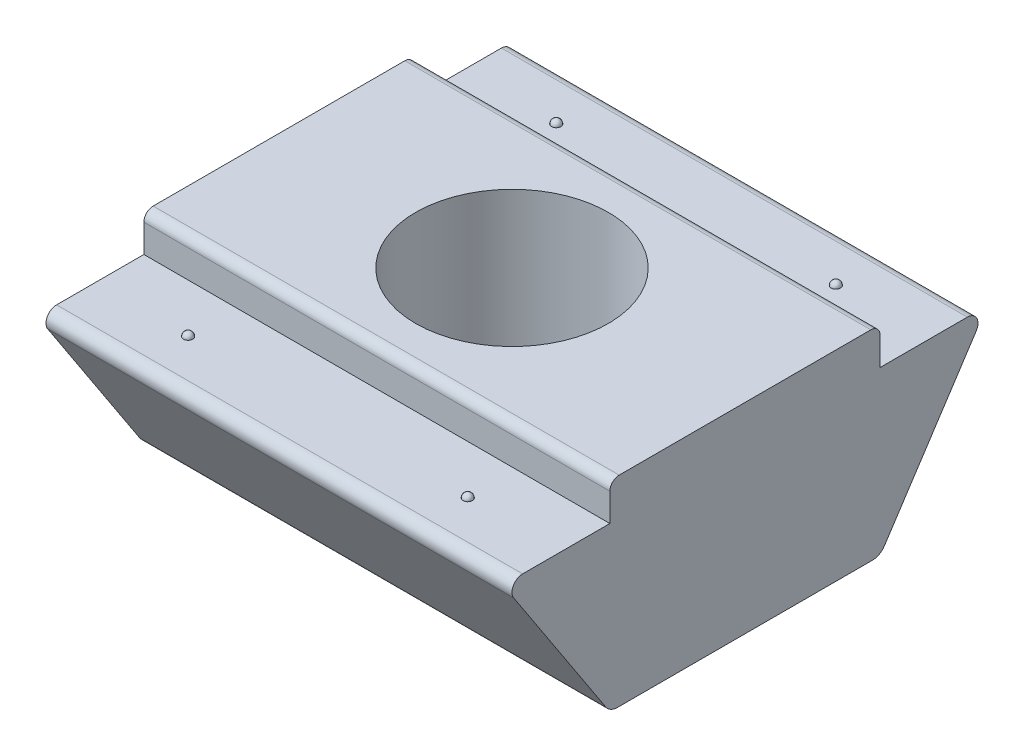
ISO-10303-21;
HEADER;
FILE_DESCRIPTION(('STEP AP214'),'2;1');
FILE_NAME('part.step','',(''),(''),'','','');
FILE_SCHEMA(('AUTOMOTIVE_DESIGN { 1 0 10303 214 1 1 1 1 }'));
ENDSEC;
DATA;
#1=APPLICATION_CONTEXT('core data for automotive mechanical design processes');
#2=APPLICATION_PROTOCOL_DEFINITION('international standard','automotive_design',2000,#1);
#3=PRODUCT_CONTEXT('',#1,'mechanical');
#4=PRODUCT('Part','Part','',(#3));
#5=PRODUCT_RELATED_PRODUCT_CATEGORY('part','',(#4));
#6=PRODUCT_DEFINITION_FORMATION('','',#4);
#7=PRODUCT_DEFINITION_CONTEXT('part definition',#1,'design');
#8=PRODUCT_DEFINITION('design','',#6,#7);
#9=PRODUCT_DEFINITION_SHAPE('','',#8);
#10=(LENGTH_UNIT() NAMED_UNIT(*) SI_UNIT(.MILLI.,.METRE.));
#11=(NAMED_UNIT(*) PLANE_ANGLE_UNIT() SI_UNIT($,.RADIAN.));
#12=(NAMED_UNIT(*) SI_UNIT($,.STERADIAN.) SOLID_ANGLE_UNIT());
#13=UNCERTAINTY_MEASURE_WITH_UNIT(LENGTH_MEASURE(1.E-05),#10,'distance_accuracy_value','');
#14=(GEOMETRIC_REPRESENTATION_CONTEXT(3) GLOBAL_UNCERTAINTY_ASSIGNED_CONTEXT((#13)) GLOBAL_UNIT_ASSIGNED_CONTEXT((#10,
#11,#12)) REPRESENTATION_CONTEXT('',''));
#15=CARTESIAN_POINT('',(0.,0.,0.));
#16=DIRECTION('',(0.,0.,1.));
#17=DIRECTION('',(1.,0.,0.));
#18=AXIS2_PLACEMENT_3D('',#15,#16,#17);
#19=CARTESIAN_POINT('',(5.,0.,-2.9));
#20=DIRECTION('',(0.,-1.,0.));
#21=DIRECTION('',(0.,0.,-1.));
#22=AXIS2_PLACEMENT_3D('',#19,#20,#21);
#23=PLANE('',#22);
#24=CARTESIAN_POINT('',(-3.,0.,-3.95));
#25=DIRECTION('',(0.,-1.,0.));
#26=DIRECTION('',(0.,0.,-1.));
#27=AXIS2_PLACEMENT_3D('',#24,#25,#26);
#28=CIRCLE('',#27,0.1);
#29=CARTESIAN_POINT('',(-3.,0.,-4.05));
#30=VERTEX_POINT('',#29);
#31=EDGE_CURVE('E42',#30,#30,#28,.F.);
#32=ORIENTED_EDGE('',*,*,#31,.F.);
#33=EDGE_LOOP('',(#32));
#34=FACE_BOUND('',#33,.T.);
#35=DIRECTION('',(0.,0.,1.));
#36=VECTOR('',#35,1.);
#37=CARTESIAN_POINT('',(-5.,0.,-2.9));
#38=LINE('',#37,#36);
#39=CARTESIAN_POINT('',(-5.,0.,-4.772));
#40=VERTEX_POINT('',#39);
#41=CARTESIAN_POINT('',(-5.,0.,-2.9));
#42=VERTEX_POINT('',#41);
#43=EDGE_CURVE('E218',#40,#42,#38,.T.);
#44=ORIENTED_EDGE('',*,*,#43,.T.);
#45=DIRECTION('',(-1.,0.,0.));
#46=VECTOR('',#45,1.);
#47=CARTESIAN_POINT('',(5.,0.,-2.9));
#48=LINE('',#47,#46);
#49=CARTESIAN_POINT('',(5.,0.,-2.9));
#50=VERTEX_POINT('',#49);
#51=EDGE_CURVE('E168',#50,#42,#48,.T.);
#52=ORIENTED_EDGE('',*,*,#51,.F.);
#53=DIRECTION('',(0.,0.,1.));
#54=VECTOR('',#53,1.);
#55=CARTESIAN_POINT('',(5.,0.,-2.9));
#56=LINE('',#55,#54);
#57=CARTESIAN_POINT('',(5.,0.,-4.772));
#58=VERTEX_POINT('',#57);
#59=EDGE_CURVE('E158',#58,#50,#56,.T.);
#60=ORIENTED_EDGE('',*,*,#59,.F.);
#61=DIRECTION('',(-1.,0.,0.));
#62=VECTOR('',#61,1.);
#63=CARTESIAN_POINT('',(5.,0.,-4.772));
#64=LINE('',#63,#62);
#65=EDGE_CURVE('E156',#58,#40,#64,.T.);
#66=ORIENTED_EDGE('',*,*,#65,.T.);
#67=EDGE_LOOP('',(#44,#52,#60,#66));
#68=FACE_BOUND('',#67,.T.);
#69=CARTESIAN_POINT('',(3.,0.,-3.95));
#70=DIRECTION('',(0.,-1.,0.));
#71=DIRECTION('',(0.,0.,-1.));
#72=AXIS2_PLACEMENT_3D('',#69,#70,#71);
#73=CIRCLE('',#72,0.1);
#74=CARTESIAN_POINT('',(3.,0.,-4.05));
#75=VERTEX_POINT('',#74);
#76=EDGE_CURVE('E11',#75,#75,#73,.F.);
#77=ORIENTED_EDGE('',*,*,#76,.F.);
#78=EDGE_LOOP('',(#77));
#79=FACE_BOUND('',#78,.T.);
#80=ADVANCED_FACE('F34',(#34,#68,#79),#23,.F.);
#81=CARTESIAN_POINT('',(5.,0.,4.772));
#82=DIRECTION('',(0.,-1.,0.));
#83=DIRECTION('',(0.,0.,-1.));
#84=AXIS2_PLACEMENT_3D('',#81,#82,#83);
#85=PLANE('',#84);
#86=CARTESIAN_POINT('',(-3.,0.,3.95));
#87=DIRECTION('',(0.,-1.,0.));
#88=DIRECTION('',(0.,0.,-1.));
#89=AXIS2_PLACEMENT_3D('',#86,#87,#88);
#90=CIRCLE('',#89,0.1);
#91=CARTESIAN_POINT('',(-3.,0.,3.85));
#92=VERTEX_POINT('',#91);
#93=EDGE_CURVE('E201',#92,#92,#90,.F.);
#94=ORIENTED_EDGE('',*,*,#93,.F.);
#95=EDGE_LOOP('',(#94));
#96=FACE_BOUND('',#95,.T.);
#97=DIRECTION('',(0.,0.,1.));
#98=VECTOR('',#97,1.);
#99=CARTESIAN_POINT('',(-5.,0.,4.772));
#100=LINE('',#99,#98);
#101=CARTESIAN_POINT('',(-5.,0.,2.9));
#102=VERTEX_POINT('',#101);
#103=CARTESIAN_POINT('',(-5.,0.,4.772));
#104=VERTEX_POINT('',#103);
#105=EDGE_CURVE('E313',#102,#104,#100,.T.);
#106=ORIENTED_EDGE('',*,*,#105,.T.);
#107=DIRECTION('',(-1.,0.,0.));
#108=VECTOR('',#107,1.);
#109=CARTESIAN_POINT('',(5.,0.,4.772));
#110=LINE('',#109,#108);
#111=CARTESIAN_POINT('',(5.,0.,4.772));
#112=VERTEX_POINT('',#111);
#113=EDGE_CURVE('E323',#112,#104,#110,.T.);
#114=ORIENTED_EDGE('',*,*,#113,.F.);
#115=DIRECTION('',(0.,0.,1.));
#116=VECTOR('',#115,1.);
#117=CARTESIAN_POINT('',(5.,0.,4.772));
#118=LINE('',#117,#116);
#119=CARTESIAN_POINT('',(5.,0.,2.9));
#120=VERTEX_POINT('',#119);
#121=EDGE_CURVE('E344',#120,#112,#118,.T.);
#122=ORIENTED_EDGE('',*,*,#121,.F.);
#123=DIRECTION('',(-1.,0.,0.));
#124=VECTOR('',#123,1.);
#125=CARTESIAN_POINT('',(5.,0.,2.9));
#126=LINE('',#125,#124);
#127=EDGE_CURVE('E326',#120,#102,#126,.T.);
#128=ORIENTED_EDGE('',*,*,#127,.T.);
#129=EDGE_LOOP('',(#106,#114,#122,#128));
#130=FACE_BOUND('',#129,.T.);
#131=CARTESIAN_POINT('',(3.,0.,3.95));
#132=DIRECTION('',(0.,-1.,0.));
#133=DIRECTION('',(0.,0.,-1.));
#134=AXIS2_PLACEMENT_3D('',#131,#132,#133);
#135=CIRCLE('',#134,0.1);
#136=CARTESIAN_POINT('',(3.,0.,3.85));
#137=VERTEX_POINT('',#136);
#138=EDGE_CURVE('E204',#137,#137,#135,.F.);
#139=ORIENTED_EDGE('',*,*,#138,.F.);
#140=EDGE_LOOP('',(#139));
#141=FACE_BOUND('',#140,.T.);
#142=ADVANCED_FACE('F213',(#96,#130,#141),#85,.F.);
#143=CARTESIAN_POINT('',(5.,-0.352986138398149,-4.96268944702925));
#144=DIRECTION('',(0.,0.548184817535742,0.836357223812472));
#145=DIRECTION('',(0.,-0.836357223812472,0.548184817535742));
#146=AXIS2_PLACEMENT_3D('',#143,#144,#145);
#147=PLANE('',#146);
#148=DIRECTION('',(0.,0.836357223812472,-0.548184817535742));
#149=VECTOR('',#148,1.);
#150=CARTESIAN_POINT('',(5.,-0.352986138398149,-4.96268944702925));
#151=LINE('',#150,#149);
#152=CARTESIAN_POINT('',(5.,-3.36445544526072,-2.98884178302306));
#153=VERTEX_POINT('',#152);
#154=CARTESIAN_POINT('',(5.,-0.352986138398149,-4.96268944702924));
#155=VERTEX_POINT('',#154);
#156=EDGE_CURVE('E138',#153,#155,#151,.T.);
#157=ORIENTED_EDGE('',*,*,#156,.F.);
#158=DIRECTION('',(-1.,0.,0.));
#159=VECTOR('',#158,1.);
#160=CARTESIAN_POINT('',(5.,-3.36445544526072,-2.98884178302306));
#161=LINE('',#160,#159);
#162=CARTESIAN_POINT('',(-5.,-3.36445544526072,-2.98884178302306));
#163=VERTEX_POINT('',#162);
#164=EDGE_CURVE('E187',#153,#163,#161,.T.);
#165=ORIENTED_EDGE('',*,*,#164,.T.);
#166=DIRECTION('',(0.,0.836357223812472,-0.548184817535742));
#167=VECTOR('',#166,1.);
#168=CARTESIAN_POINT('',(-5.,-0.352986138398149,-4.96268944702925));
#169=LINE('',#168,#167);
#170=CARTESIAN_POINT('',(-5.,-0.352986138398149,-4.96268944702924));
#171=VERTEX_POINT('',#170);
#172=EDGE_CURVE('E162',#163,#171,#169,.T.);
#173=ORIENTED_EDGE('',*,*,#172,.T.);
#174=DIRECTION('',(-1.,0.,0.));
#175=VECTOR('',#174,1.);
#176=CARTESIAN_POINT('',(5.,-0.352986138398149,-4.96268944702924));
#177=LINE('',#176,#175);
#178=EDGE_CURVE('E154',#155,#171,#177,.T.);
#179=ORIENTED_EDGE('',*,*,#178,.F.);
#180=EDGE_LOOP('',(#157,#165,#173,#179));
#181=FACE_BOUND('',#180,.T.);
#182=ADVANCED_FACE('F160',(#181),#147,.F.);
#183=CARTESIAN_POINT('',(5.,-0.227999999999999,-4.772));
#184=DIRECTION('',(-1.,0.,0.));
#185=DIRECTION('',(0.,0.,1.));
#186=AXIS2_PLACEMENT_3D('',#183,#184,#185);
#187=CYLINDRICAL_SURFACE('',#186,0.228000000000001);
#188=CARTESIAN_POINT('',(-5.,-0.227999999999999,-4.772));
#189=DIRECTION('',(1.,0.,0.));
#190=DIRECTION('',(0.,0.,1.));
#191=AXIS2_PLACEMENT_3D('',#188,#189,#190);
#192=CIRCLE('',#191,0.228000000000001);
#193=EDGE_CURVE('E293',#171,#40,#192,.T.);
#194=ORIENTED_EDGE('',*,*,#193,.T.);
#195=ORIENTED_EDGE('',*,*,#65,.F.);
#196=CARTESIAN_POINT('',(5.,-0.227999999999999,-4.772));
#197=DIRECTION('',(1.,0.,0.));
#198=DIRECTION('',(0.,0.,1.));
#199=AXIS2_PLACEMENT_3D('',#196,#197,#198);
#200=CIRCLE('',#199,0.228000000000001);
#201=EDGE_CURVE('E141',#155,#58,#200,.T.);
#202=ORIENTED_EDGE('',*,*,#201,.F.);
#203=ORIENTED_EDGE('',*,*,#178,.T.);
#204=EDGE_LOOP('',(#194,#195,#202,#203));
#205=FACE_BOUND('',#204,.T.);
#206=ADVANCED_FACE('F153',(#205),#187,.T.);
#207=CARTESIAN_POINT('',(5.,0.799999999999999,-2.9));
#208=DIRECTION('',(0.,0.,1.));
#209=DIRECTION('',(1.,0.,0.));
#210=AXIS2_PLACEMENT_3D('',#207,#208,#209);
#211=PLANE('',#210);
#212=DIRECTION('',(0.,1.,0.));
#213=VECTOR('',#212,1.);
#214=CARTESIAN_POINT('',(-5.,0.799999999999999,-2.9));
#215=LINE('',#214,#213);
#216=CARTESIAN_POINT('',(-5.,0.6,-2.9));
#217=VERTEX_POINT('',#216);
#218=EDGE_CURVE('E305',#42,#217,#215,.T.);
#219=ORIENTED_EDGE('',*,*,#218,.T.);
#220=DIRECTION('',(-1.,0.,0.));
#221=VECTOR('',#220,1.);
#222=CARTESIAN_POINT('',(5.,0.6,-2.9));
#223=LINE('',#222,#221);
#224=CARTESIAN_POINT('',(5.,0.6,-2.9));
#225=VERTEX_POINT('',#224);
#226=EDGE_CURVE('E178',#217,#225,#223,.F.);
#227=ORIENTED_EDGE('',*,*,#226,.T.);
#228=DIRECTION('',(0.,1.,0.));
#229=VECTOR('',#228,1.);
#230=CARTESIAN_POINT('',(5.,0.799999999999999,-2.9));
#231=LINE('',#230,#229);
#232=EDGE_CURVE('E332',#50,#225,#231,.T.);
#233=ORIENTED_EDGE('',*,*,#232,.F.);
#234=ORIENTED_EDGE('',*,*,#51,.T.);
#235=EDGE_LOOP('',(#219,#227,#233,#234));
#236=FACE_BOUND('',#235,.T.);
#237=ADVANCED_FACE('F270',(#236),#211,.F.);
#238=CARTESIAN_POINT('',(5.,0.799999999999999,2.9));
#239=DIRECTION('',(0.,-1.,0.));
#240=DIRECTION('',(0.,0.,-1.));
#241=AXIS2_PLACEMENT_3D('',#238,#239,#240);
#242=PLANE('',#241);
#243=CARTESIAN_POINT('',(0.,0.799999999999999,0.));
#244=DIRECTION('',(0.,1.,0.));
#245=DIRECTION('',(0.,0.,1.));
#246=AXIS2_PLACEMENT_3D('',#243,#244,#245);
#247=CIRCLE('',#246,2.067);
#248=CARTESIAN_POINT('',(0.,0.799999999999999,2.067));
#249=VERTEX_POINT('',#248);
#250=EDGE_CURVE('E298',#249,#249,#247,.T.);
#251=ORIENTED_EDGE('',*,*,#250,.F.);
#252=EDGE_LOOP('',(#251));
#253=FACE_BOUND('',#252,.T.);
#254=DIRECTION('',(0.,0.,1.));
#255=VECTOR('',#254,1.);
#256=CARTESIAN_POINT('',(5.,0.799999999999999,2.9));
#257=LINE('',#256,#255);
#258=CARTESIAN_POINT('',(5.,0.799999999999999,-2.7));
#259=VERTEX_POINT('',#258);
#260=CARTESIAN_POINT('',(5.,0.799999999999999,2.7));
#261=VERTEX_POINT('',#260);
#262=EDGE_CURVE('E340',#259,#261,#257,.T.);
#263=ORIENTED_EDGE('',*,*,#262,.F.);
#264=DIRECTION('',(-1.,0.,0.));
#265=VECTOR('',#264,1.);
#266=CARTESIAN_POINT('',(5.,0.799999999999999,-2.7));
#267=LINE('',#266,#265);
#268=CARTESIAN_POINT('',(-5.,0.799999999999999,-2.7));
#269=VERTEX_POINT('',#268);
#270=EDGE_CURVE('E166',#259,#269,#267,.T.);
#271=ORIENTED_EDGE('',*,*,#270,.T.);
#272=DIRECTION('',(0.,0.,1.));
#273=VECTOR('',#272,1.);
#274=CARTESIAN_POINT('',(-5.,0.799999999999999,2.9));
#275=LINE('',#274,#273);
#276=CARTESIAN_POINT('',(-5.,0.799999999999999,2.7));
#277=VERTEX_POINT('',#276);
#278=EDGE_CURVE('E308',#269,#277,#275,.T.);
#279=ORIENTED_EDGE('',*,*,#278,.T.);
#280=DIRECTION('',(-1.,0.,0.));
#281=VECTOR('',#280,1.);
#282=CARTESIAN_POINT('',(5.,0.799999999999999,2.7));
#283=LINE('',#282,#281);
#284=EDGE_CURVE('E164',#277,#261,#283,.F.);
#285=ORIENTED_EDGE('',*,*,#284,.T.);
#286=EDGE_LOOP('',(#263,#271,#279,#285));
#287=FACE_BOUND('',#286,.T.);
#288=ADVANCED_FACE('F266',(#253,#287),#242,.F.);
#289=CARTESIAN_POINT('',(5.,0.,2.9));
#290=DIRECTION('',(0.,0.,-1.));
#291=DIRECTION('',(-1.,0.,0.));
#292=AXIS2_PLACEMENT_3D('',#289,#290,#291);
#293=PLANE('',#292);
#294=DIRECTION('',(0.,-1.,0.));
#295=VECTOR('',#294,1.);
#296=CARTESIAN_POINT('',(5.,0.,2.9));
#297=LINE('',#296,#295);
#298=CARTESIAN_POINT('',(5.,0.599999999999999,2.9));
#299=VERTEX_POINT('',#298);
#300=EDGE_CURVE('E342',#299,#120,#297,.T.);
#301=ORIENTED_EDGE('',*,*,#300,.F.);
#302=DIRECTION('',(-1.,0.,0.));
#303=VECTOR('',#302,1.);
#304=CARTESIAN_POINT('',(5.,0.599999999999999,2.9));
#305=LINE('',#304,#303);
#306=CARTESIAN_POINT('',(-5.,0.599999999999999,2.9));
#307=VERTEX_POINT('',#306);
#308=EDGE_CURVE('E184',#299,#307,#305,.T.);
#309=ORIENTED_EDGE('',*,*,#308,.T.);
#310=DIRECTION('',(0.,-1.,0.));
#311=VECTOR('',#310,1.);
#312=CARTESIAN_POINT('',(-5.,0.,2.9));
#313=LINE('',#312,#311);
#314=EDGE_CURVE('E311',#307,#102,#313,.T.);
#315=ORIENTED_EDGE('',*,*,#314,.T.);
#316=ORIENTED_EDGE('',*,*,#127,.F.);
#317=EDGE_LOOP('',(#301,#309,#315,#316));
#318=FACE_BOUND('',#317,.T.);
#319=ADVANCED_FACE('F259',(#318),#293,.F.);
#320=CARTESIAN_POINT('',(5.,-0.228,4.772));
#321=DIRECTION('',(-1.,0.,0.));
#322=DIRECTION('',(0.,0.,1.));
#323=AXIS2_PLACEMENT_3D('',#320,#321,#322);
#324=CYLINDRICAL_SURFACE('',#323,0.228000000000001);
#325=CARTESIAN_POINT('',(-5.,-0.228,4.772));
#326=DIRECTION('',(1.,0.,0.));
#327=DIRECTION('',(0.,0.,1.));
#328=AXIS2_PLACEMENT_3D('',#325,#326,#327);
#329=CIRCLE('',#328,0.228000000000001);
#330=CARTESIAN_POINT('',(-5.,-0.35298613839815,4.96268944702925));
#331=VERTEX_POINT('',#330);
#332=EDGE_CURVE('E315',#104,#331,#329,.T.);
#333=ORIENTED_EDGE('',*,*,#332,.T.);
#334=DIRECTION('',(-1.,0.,0.));
#335=VECTOR('',#334,1.);
#336=CARTESIAN_POINT('',(5.,-0.35298613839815,4.96268944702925));
#337=LINE('',#336,#335);
#338=CARTESIAN_POINT('',(5.,-0.35298613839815,4.96268944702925));
#339=VERTEX_POINT('',#338);
#340=EDGE_CURVE('E320',#339,#331,#337,.T.);
#341=ORIENTED_EDGE('',*,*,#340,.F.);
#342=CARTESIAN_POINT('',(5.,-0.228,4.772));
#343=DIRECTION('',(1.,0.,0.));
#344=DIRECTION('',(0.,0.,1.));
#345=AXIS2_PLACEMENT_3D('',#342,#343,#344);
#346=CIRCLE('',#345,0.228000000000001);
#347=EDGE_CURVE('E350',#112,#339,#346,.T.);
#348=ORIENTED_EDGE('',*,*,#347,.F.);
#349=ORIENTED_EDGE('',*,*,#113,.T.);
#350=EDGE_LOOP('',(#333,#341,#348,#349));
#351=FACE_BOUND('',#350,.T.);
#352=ADVANCED_FACE('F256',(#351),#324,.T.);
#353=CARTESIAN_POINT('',(5.,-3.5,2.9));
#354=DIRECTION('',(0.,0.548184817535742,-0.836357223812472));
#355=DIRECTION('',(0.,0.836357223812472,0.548184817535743));
#356=AXIS2_PLACEMENT_3D('',#353,#354,#355);
#357=PLANE('',#356);
#358=DIRECTION('',(0.,-0.836357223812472,-0.548184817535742));
#359=VECTOR('',#358,1.);
#360=CARTESIAN_POINT('',(-5.,-3.5,2.9));
#361=LINE('',#360,#359);
#362=CARTESIAN_POINT('',(-5.,-3.36445544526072,2.98884178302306));
#363=VERTEX_POINT('',#362);
#364=EDGE_CURVE('E317',#331,#363,#361,.T.);
#365=ORIENTED_EDGE('',*,*,#364,.T.);
#366=DIRECTION('',(-1.,0.,0.));
#367=VECTOR('',#366,1.);
#368=CARTESIAN_POINT('',(5.,-3.36445544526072,2.98884178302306));
#369=LINE('',#368,#367);
#370=CARTESIAN_POINT('',(5.,-3.36445544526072,2.98884178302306));
#371=VERTEX_POINT('',#370);
#372=EDGE_CURVE('E49',#363,#371,#369,.F.);
#373=ORIENTED_EDGE('',*,*,#372,.T.);
#374=DIRECTION('',(0.,-0.836357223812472,-0.548184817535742));
#375=VECTOR('',#374,1.);
#376=CARTESIAN_POINT('',(5.,-3.5,2.9));
#377=LINE('',#376,#375);
#378=EDGE_CURVE('E351',#339,#371,#377,.T.);
#379=ORIENTED_EDGE('',*,*,#378,.F.);
#380=ORIENTED_EDGE('',*,*,#340,.T.);
#381=EDGE_LOOP('',(#365,#373,#379,#380));
#382=FACE_BOUND('',#381,.T.);
#383=ADVANCED_FACE('F252',(#382),#357,.F.);
#384=CARTESIAN_POINT('',(5.,-3.5,-2.9));
#385=DIRECTION('',(0.,1.,0.));
#386=DIRECTION('',(0.,0.,1.));
#387=AXIS2_PLACEMENT_3D('',#384,#385,#386);
#388=PLANE('',#387);
#389=CARTESIAN_POINT('',(0.,-3.5,0.));
#390=DIRECTION('',(0.,1.,0.));
#391=DIRECTION('',(0.,0.,1.));
#392=AXIS2_PLACEMENT_3D('',#389,#390,#391);
#393=CIRCLE('',#392,2.067);
#394=CARTESIAN_POINT('',(0.,-3.5,2.067));
#395=VERTEX_POINT('',#394);
#396=EDGE_CURVE('E294',#395,#395,#393,.T.);
#397=ORIENTED_EDGE('',*,*,#396,.T.);
#398=EDGE_LOOP('',(#397));
#399=FACE_BOUND('',#398,.T.);
#400=DIRECTION('',(0.,0.,-1.));
#401=VECTOR('',#400,1.);
#402=CARTESIAN_POINT('',(-5.,-3.5,-2.9));
#403=LINE('',#402,#401);
#404=CARTESIAN_POINT('',(-5.,-3.5,2.73793461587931));
#405=VERTEX_POINT('',#404);
#406=CARTESIAN_POINT('',(-5.,-3.5,-2.73793461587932));
#407=VERTEX_POINT('',#406);
#408=EDGE_CURVE('E149',#405,#407,#403,.T.);
#409=ORIENTED_EDGE('',*,*,#408,.T.);
#410=DIRECTION('',(-1.,0.,0.));
#411=VECTOR('',#410,1.);
#412=CARTESIAN_POINT('',(5.,-3.5,-2.73793461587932));
#413=LINE('',#412,#411);
#414=CARTESIAN_POINT('',(5.,-3.5,-2.73793461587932));
#415=VERTEX_POINT('',#414);
#416=EDGE_CURVE('E57',#407,#415,#413,.F.);
#417=ORIENTED_EDGE('',*,*,#416,.T.);
#418=DIRECTION('',(0.,0.,-1.));
#419=VECTOR('',#418,1.);
#420=CARTESIAN_POINT('',(5.,-3.5,-2.9));
#421=LINE('',#420,#419);
#422=CARTESIAN_POINT('',(5.,-3.5,2.73793461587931));
#423=VERTEX_POINT('',#422);
#424=EDGE_CURVE('E301',#423,#415,#421,.T.);
#425=ORIENTED_EDGE('',*,*,#424,.F.);
#426=DIRECTION('',(-1.,0.,0.));
#427=VECTOR('',#426,1.);
#428=CARTESIAN_POINT('',(5.,-3.5,2.73793461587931));
#429=LINE('',#428,#427);
#430=EDGE_CURVE('E193',#423,#405,#429,.T.);
#431=ORIENTED_EDGE('',*,*,#430,.T.);
#432=EDGE_LOOP('',(#409,#417,#425,#431));
#433=FACE_BOUND('',#432,.T.);
#434=ADVANCED_FACE('F245',(#399,#433),#388,.F.);
#435=CARTESIAN_POINT('',(5.,-0.228,4.772));
#436=DIRECTION('',(-1.,0.,0.));
#437=DIRECTION('',(0.,0.,1.));
#438=AXIS2_PLACEMENT_3D('',#435,#436,#437);
#439=PLANE('',#438);
#440=ORIENTED_EDGE('',*,*,#424,.T.);
#441=CARTESIAN_POINT('',(5.,-3.2,-2.73793461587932));
#442=DIRECTION('',(-1.,0.,0.));
#443=DIRECTION('',(0.,0.,1.));
#444=AXIS2_PLACEMENT_3D('',#441,#442,#443);
#445=CIRCLE('',#444,0.3);
#446=EDGE_CURVE('E144',#415,#153,#445,.F.);
#447=ORIENTED_EDGE('',*,*,#446,.T.);
#448=ORIENTED_EDGE('',*,*,#156,.T.);
#449=ORIENTED_EDGE('',*,*,#201,.T.);
#450=ORIENTED_EDGE('',*,*,#59,.T.);
#451=ORIENTED_EDGE('',*,*,#232,.T.);
#452=CARTESIAN_POINT('',(5.,0.6,-2.7));
#453=DIRECTION('',(-1.,0.,0.));
#454=DIRECTION('',(0.,0.,1.));
#455=AXIS2_PLACEMENT_3D('',#452,#453,#454);
#456=CIRCLE('',#455,0.2);
#457=EDGE_CURVE('E182',#225,#259,#456,.F.);
#458=ORIENTED_EDGE('',*,*,#457,.T.);
#459=ORIENTED_EDGE('',*,*,#262,.T.);
#460=CARTESIAN_POINT('',(5.,0.599999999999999,2.7));
#461=DIRECTION('',(-1.,0.,0.));
#462=DIRECTION('',(0.,0.,1.));
#463=AXIS2_PLACEMENT_3D('',#460,#461,#462);
#464=CIRCLE('',#463,0.2);
#465=EDGE_CURVE('E180',#261,#299,#464,.F.);
#466=ORIENTED_EDGE('',*,*,#465,.T.);
#467=ORIENTED_EDGE('',*,*,#300,.T.);
#468=ORIENTED_EDGE('',*,*,#121,.T.);
#469=ORIENTED_EDGE('',*,*,#347,.T.);
#470=ORIENTED_EDGE('',*,*,#378,.T.);
#471=CARTESIAN_POINT('',(5.,-3.2,2.73793461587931));
#472=DIRECTION('',(-1.,0.,0.));
#473=DIRECTION('',(0.,0.,1.));
#474=AXIS2_PLACEMENT_3D('',#471,#472,#473);
#475=CIRCLE('',#474,0.3);
#476=EDGE_CURVE('E197',#371,#423,#475,.F.);
#477=ORIENTED_EDGE('',*,*,#476,.T.);
#478=EDGE_LOOP('',(#440,#447,#448,#449,#450,#451,#458,#459,#466,#467,#468,#469,#470,#477));
#479=FACE_BOUND('',#478,.T.);
#480=ADVANCED_FACE('F140',(#479),#439,.F.);
#481=CARTESIAN_POINT('',(-5.,-0.228,4.772));
#482=DIRECTION('',(-1.,0.,0.));
#483=DIRECTION('',(0.,0.,1.));
#484=AXIS2_PLACEMENT_3D('',#481,#482,#483);
#485=PLANE('',#484);
#486=ORIENTED_EDGE('',*,*,#172,.F.);
#487=CARTESIAN_POINT('',(-5.,-3.2,-2.73793461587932));
#488=DIRECTION('',(-1.,0.,0.));
#489=DIRECTION('',(0.,0.,1.));
#490=AXIS2_PLACEMENT_3D('',#487,#488,#489);
#491=CIRCLE('',#490,0.3);
#492=EDGE_CURVE('E191',#163,#407,#491,.T.);
#493=ORIENTED_EDGE('',*,*,#492,.T.);
#494=ORIENTED_EDGE('',*,*,#408,.F.);
#495=CARTESIAN_POINT('',(-5.,-3.2,2.73793461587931));
#496=DIRECTION('',(-1.,0.,0.));
#497=DIRECTION('',(0.,0.,1.));
#498=AXIS2_PLACEMENT_3D('',#495,#496,#497);
#499=CIRCLE('',#498,0.3);
#500=EDGE_CURVE('E189',#405,#363,#499,.T.);
#501=ORIENTED_EDGE('',*,*,#500,.T.);
#502=ORIENTED_EDGE('',*,*,#364,.F.);
#503=ORIENTED_EDGE('',*,*,#332,.F.);
#504=ORIENTED_EDGE('',*,*,#105,.F.);
#505=ORIENTED_EDGE('',*,*,#314,.F.);
#506=CARTESIAN_POINT('',(-5.,0.599999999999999,2.7));
#507=DIRECTION('',(-1.,0.,0.));
#508=DIRECTION('',(0.,0.,1.));
#509=AXIS2_PLACEMENT_3D('',#506,#507,#508);
#510=CIRCLE('',#509,0.2);
#511=EDGE_CURVE('E174',#307,#277,#510,.T.);
#512=ORIENTED_EDGE('',*,*,#511,.T.);
#513=ORIENTED_EDGE('',*,*,#278,.F.);
#514=CARTESIAN_POINT('',(-5.,0.6,-2.7));
#515=DIRECTION('',(-1.,0.,0.));
#516=DIRECTION('',(0.,0.,1.));
#517=AXIS2_PLACEMENT_3D('',#514,#515,#516);
#518=CIRCLE('',#517,0.2);
#519=EDGE_CURVE('E176',#269,#217,#518,.T.);
#520=ORIENTED_EDGE('',*,*,#519,.T.);
#521=ORIENTED_EDGE('',*,*,#218,.F.);
#522=ORIENTED_EDGE('',*,*,#43,.F.);
#523=ORIENTED_EDGE('',*,*,#193,.F.);
#524=EDGE_LOOP('',(#486,#493,#494,#501,#502,#503,#504,#505,#512,#513,#520,#521,#522,#523));
#525=FACE_BOUND('',#524,.T.);
#526=ADVANCED_FACE('F244',(#525),#485,.T.);
#527=CARTESIAN_POINT('',(5.,0.6,-2.7));
#528=DIRECTION('',(-1.,0.,0.));
#529=DIRECTION('',(0.,0.,1.));
#530=AXIS2_PLACEMENT_3D('',#527,#528,#529);
#531=CYLINDRICAL_SURFACE('',#530,0.2);
#532=ORIENTED_EDGE('',*,*,#457,.F.);
#533=ORIENTED_EDGE('',*,*,#226,.F.);
#534=ORIENTED_EDGE('',*,*,#519,.F.);
#535=ORIENTED_EDGE('',*,*,#270,.F.);
#536=EDGE_LOOP('',(#532,#533,#534,#535));
#537=FACE_BOUND('',#536,.T.);
#538=ADVANCED_FACE('F248',(#537),#531,.T.);
#539=CARTESIAN_POINT('',(5.,0.599999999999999,2.7));
#540=DIRECTION('',(-1.,0.,0.));
#541=DIRECTION('',(0.,0.,1.));
#542=AXIS2_PLACEMENT_3D('',#539,#540,#541);
#543=CYLINDRICAL_SURFACE('',#542,0.2);
#544=ORIENTED_EDGE('',*,*,#465,.F.);
#545=ORIENTED_EDGE('',*,*,#284,.F.);
#546=ORIENTED_EDGE('',*,*,#511,.F.);
#547=ORIENTED_EDGE('',*,*,#308,.F.);
#548=EDGE_LOOP('',(#544,#545,#546,#547));
#549=FACE_BOUND('',#548,.T.);
#550=ADVANCED_FACE('F281',(#549),#543,.T.);
#551=CARTESIAN_POINT('',(5.,-3.2,-2.73793461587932));
#552=DIRECTION('',(-1.,0.,0.));
#553=DIRECTION('',(0.,0.,1.));
#554=AXIS2_PLACEMENT_3D('',#551,#552,#553);
#555=CYLINDRICAL_SURFACE('',#554,0.3);
#556=ORIENTED_EDGE('',*,*,#446,.F.);
#557=ORIENTED_EDGE('',*,*,#416,.F.);
#558=ORIENTED_EDGE('',*,*,#492,.F.);
#559=ORIENTED_EDGE('',*,*,#164,.F.);
#560=EDGE_LOOP('',(#556,#557,#558,#559));
#561=FACE_BOUND('',#560,.T.);
#562=ADVANCED_FACE('F284',(#561),#555,.T.);
#563=CARTESIAN_POINT('',(5.,-3.2,2.73793461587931));
#564=DIRECTION('',(-1.,0.,0.));
#565=DIRECTION('',(0.,0.,1.));
#566=AXIS2_PLACEMENT_3D('',#563,#564,#565);
#567=CYLINDRICAL_SURFACE('',#566,0.3);
#568=ORIENTED_EDGE('',*,*,#476,.F.);
#569=ORIENTED_EDGE('',*,*,#372,.F.);
#570=ORIENTED_EDGE('',*,*,#500,.F.);
#571=ORIENTED_EDGE('',*,*,#430,.F.);
#572=EDGE_LOOP('',(#568,#569,#570,#571));
#573=FACE_BOUND('',#572,.T.);
#574=ADVANCED_FACE('F36',(#573),#567,.T.);
#575=CARTESIAN_POINT('',(-3.,0.,3.95));
#576=DIRECTION('',(0.,-1.,0.));
#577=DIRECTION('',(0.,0.,1.));
#578=AXIS2_PLACEMENT_3D('',#575,#576,#577);
#579=SPHERICAL_SURFACE('',#578,0.1);
#580=ORIENTED_EDGE('',*,*,#93,.T.);
#581=EDGE_LOOP('',(#580));
#582=FACE_BOUND('',#581,.T.);
#583=ADVANCED_FACE('F237',(#582),#579,.T.);
#584=CARTESIAN_POINT('',(3.,0.,3.95));
#585=DIRECTION('',(0.,-1.,0.));
#586=DIRECTION('',(0.,0.,1.));
#587=AXIS2_PLACEMENT_3D('',#584,#585,#586);
#588=SPHERICAL_SURFACE('',#587,0.1);
#589=ORIENTED_EDGE('',*,*,#138,.T.);
#590=EDGE_LOOP('',(#589));
#591=FACE_BOUND('',#590,.T.);
#592=ADVANCED_FACE('F232',(#591),#588,.T.);
#593=CARTESIAN_POINT('',(-3.,0.,-3.95));
#594=DIRECTION('',(0.,-1.,0.));
#595=DIRECTION('',(0.,0.,1.));
#596=AXIS2_PLACEMENT_3D('',#593,#594,#595);
#597=SPHERICAL_SURFACE('',#596,0.1);
#598=ORIENTED_EDGE('',*,*,#31,.T.);
#599=EDGE_LOOP('',(#598));
#600=FACE_BOUND('',#599,.T.);
#601=ADVANCED_FACE('F209',(#600),#597,.T.);
#602=CARTESIAN_POINT('',(3.,0.,-3.95));
#603=DIRECTION('',(0.,-1.,0.));
#604=DIRECTION('',(0.,0.,1.));
#605=AXIS2_PLACEMENT_3D('',#602,#603,#604);
#606=SPHERICAL_SURFACE('',#605,0.1);
#607=ORIENTED_EDGE('',*,*,#76,.T.);
#608=EDGE_LOOP('',(#607));
#609=FACE_BOUND('',#608,.T.);
#610=ADVANCED_FACE('F222',(#609),#606,.T.);
#611=CARTESIAN_POINT('',(0.,0.799999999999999,0.));
#612=DIRECTION('',(0.,1.,0.));
#613=DIRECTION('',(0.,0.,1.));
#614=AXIS2_PLACEMENT_3D('',#611,#612,#613);
#615=CYLINDRICAL_SURFACE('',#614,2.067);
#616=ORIENTED_EDGE('',*,*,#396,.F.);
#617=EDGE_LOOP('',(#616));
#618=FACE_BOUND('',#617,.T.);
#619=ORIENTED_EDGE('',*,*,#250,.T.);
#620=EDGE_LOOP('',(#619));
#621=FACE_BOUND('',#620,.T.);
#622=ADVANCED_FACE('F224',(#618,#621),#615,.F.);
#623=CLOSED_SHELL('',(#80,#142,#182,#206,#237,#288,#319,#352,#383,#434,#480,#526,#538,#550,#562,
#574,#583,#592,#601,#610,#622));
#624=MANIFOLD_SOLID_BREP('B2',#623);
#625=ADVANCED_BREP_SHAPE_REPRESENTATION('',(#18,#624),#14);
#626=SHAPE_DEFINITION_REPRESENTATION(#9,#625);
ENDSEC;
END-ISO-10303-21;
